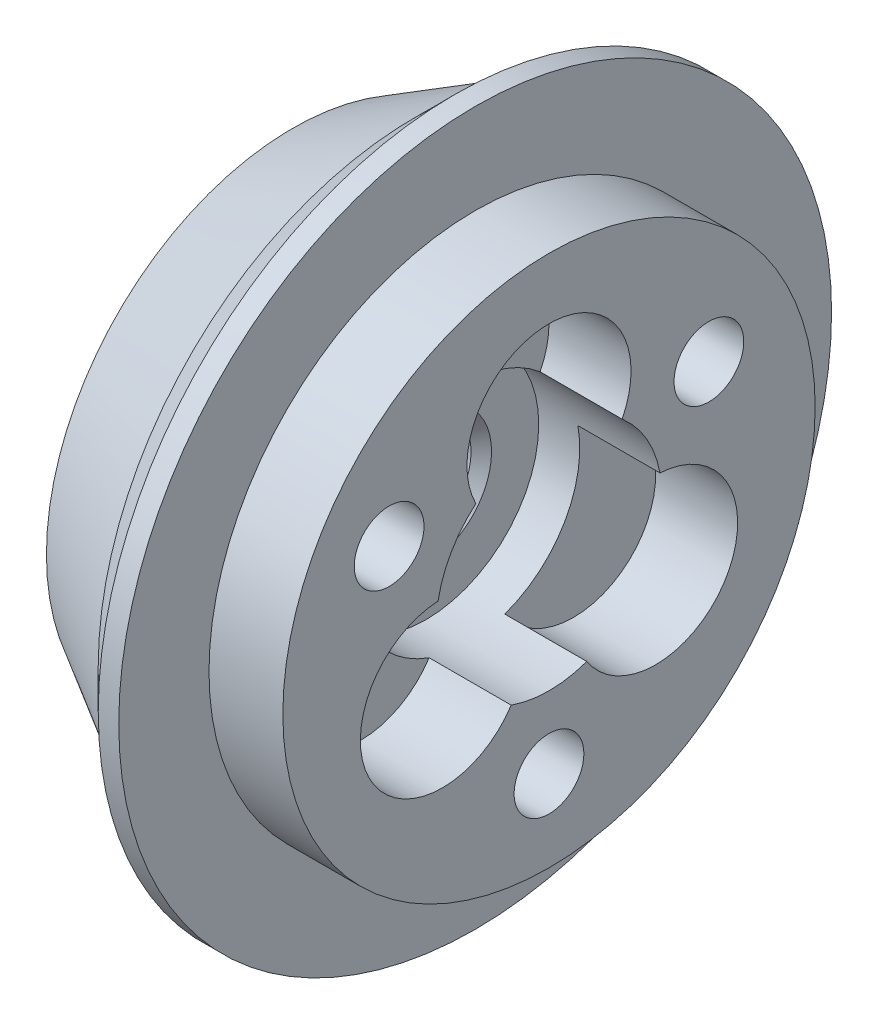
from build123d import *

# Parameters (mm, degrees)
CHANFREIN1_SIZE            = 0.2
CHANFREIN2_SIZE            = 1
ESQUISSE3_R                = 8
ENL_V_MAT_EXTRU_1_DEPTH    = 8
ENL_V_MAT_EXTRU_2_DEPTH    = 10
TROU_TARAUD_M8X1_251_D     = 6.8
TROU_TARAUD_M8X1_251_DEPTH = 22.25
TROU_TARAUD_M8X1_251_TIP   = 2.042926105


with BuildPart() as part:
    # Esquisse1 → R_volution1 (revolve)
    with BuildSketch(Plane.XY, mode=Mode.PRIVATE) as r_volution1_sk:
        Polygon((0, 0), (0, 24), (11.95, 30.9), (15.8, 34.75), (17.8, 34.75), (17.8, 25.95), (25, 25.95), (25, 0), align=None)
    revolve(r_volution1_sk.sketch.rotate(Axis((0, 0, 0), (1, 0, 0)), 90), axis=Axis((0, 0, 0), (1, 0, 0)))

    # Esquisse2 → Enl_vement de mati_re-R_volution1 (revolve, cut)
    with BuildSketch(Plane.XY, mode=Mode.PRIVATE) as enl_vement_de_mati_re_r_volution1_sk:
        Polygon((0, 2.01), (6, 2.01), (6, 5.4), (13, 5.4), (13, 11), (25, 11), (25, 0), (0, 0), align=None)
    revolve(enl_vement_de_mati_re_r_volution1_sk.sketch.rotate(Axis((0, 0, 0), (1, 0, 0)), 90), axis=Axis((0, 0, 0), (1, 0, 0)), mode=Mode.SUBTRACT)

    # Chanfrein1
    chanfrein1_edges = [part.edges().sort_by_distance(p)[0] for p in [
        (0, 0, -2.01),
        (6, 0, -2.01),
    ]]
    chamfer(chanfrein1_edges, length=CHANFREIN1_SIZE)

    # Chanfrein2
    chanfrein2_edges = [part.edges().sort_by_distance(p)[0] for p in [
        (13, 0, -5.4),
    ]]
    chamfer(chanfrein2_edges, length=CHANFREIN2_SIZE)

    # Esquisse3 → Enl_v. mat.-Extru.1 (cut)
    with BuildSketch(Plane(origin=(25, 0, 0), x_dir=(0, 0, -1), z_dir=(1, 0, 0))):
        with Locations((0, 12)):
            Circle(ESQUISSE3_R)
        with Locations((10.392304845, -6)):
            Circle(ESQUISSE3_R)
        with Locations((-10.392304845, -6)):
            Circle(ESQUISSE3_R)
    extrude(amount=-ENL_V_MAT_EXTRU_1_DEPTH, mode=Mode.SUBTRACT)

    # Esquisse6 → Enl_v. mat.-Extru.2 (cut)
    with BuildSketch(Plane.ZY):
        with BuildLine():
            ThreePointArc((3.078947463, 3.281780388), (4.5, -1.1e-07), (3.078947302, -3.281780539))
            ThreePointArc((3.078947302, -3.281780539), (2.853577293, -10.349255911), (9.921052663, -10.574625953))
            ThreePointArc((9.921052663, -10.574625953), (14.5, -7.5e-08), (9.921052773, 10.57462585))
            ThreePointArc((9.921052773, 10.57462585), (2.853577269, 10.349255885), (3.078947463, 3.281780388))
        make_face()
        with BuildLine():
            ThreePointArc((-3.078947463, -3.281780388), (-4.5, 1.6e-08), (-3.078947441, 3.28178041))
            ThreePointArc((-3.078947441, 3.28178041), (-2.853577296, 10.349255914), (-9.921052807, 10.574625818))
            ThreePointArc((-9.921052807, 10.574625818), (-14.5, -6e-09), (-9.921052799, -10.574625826))
            ThreePointArc((-9.921052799, -10.574625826), (-2.853577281, -10.349255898), (-3.078947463, -3.281780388))
        make_face()
    extrude(amount=-ENL_V_MAT_EXTRU_2_DEPTH, mode=Mode.SUBTRACT)

    # Trou taraud_ M8x1.251
    with Locations(Plane(origin=(25, 9, 15.588457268), x_dir=(0, 0, 1), z_dir=(1, 0, 0))):
        with Locations((0, 0), (-31.176914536, 0), (-15.588457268, 27)):
            Hole(TROU_TARAUD_M8X1_251_D / 2, depth=TROU_TARAUD_M8X1_251_DEPTH)
            with Locations((0, 0, -(TROU_TARAUD_M8X1_251_DEPTH + TROU_TARAUD_M8X1_251_TIP / 2))):  # 118° drill point
                Cone(0, TROU_TARAUD_M8X1_251_D / 2, TROU_TARAUD_M8X1_251_TIP, mode=Mode.SUBTRACT)


solid = part.part
